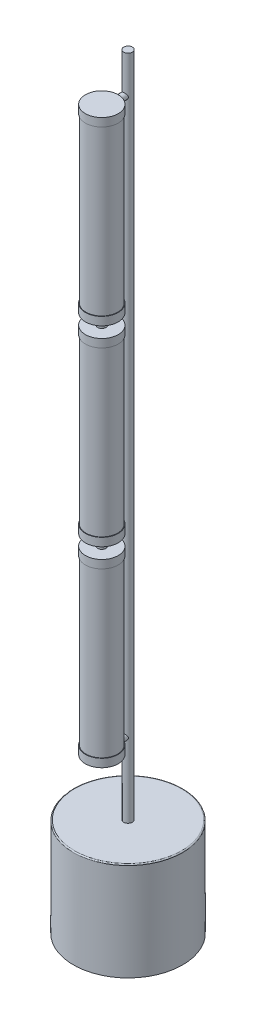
ISO-10303-21;
HEADER;
FILE_DESCRIPTION(('STEP AP214'),'2;1');
FILE_NAME('part.step','',(''),(''),'','','');
FILE_SCHEMA(('AUTOMOTIVE_DESIGN { 1 0 10303 214 1 1 1 1 }'));
ENDSEC;
DATA;
#1=APPLICATION_CONTEXT('core data for automotive mechanical design processes');
#2=APPLICATION_PROTOCOL_DEFINITION('international standard','automotive_design',2000,#1);
#3=PRODUCT_CONTEXT('',#1,'mechanical');
#4=PRODUCT('Part','Part','',(#3));
#5=PRODUCT_RELATED_PRODUCT_CATEGORY('part','',(#4));
#6=PRODUCT_DEFINITION_FORMATION('','',#4);
#7=PRODUCT_DEFINITION_CONTEXT('part definition',#1,'design');
#8=PRODUCT_DEFINITION('design','',#6,#7);
#9=PRODUCT_DEFINITION_SHAPE('','',#8);
#10=(LENGTH_UNIT() NAMED_UNIT(*) SI_UNIT(.MILLI.,.METRE.));
#11=(NAMED_UNIT(*) PLANE_ANGLE_UNIT() SI_UNIT($,.RADIAN.));
#12=(NAMED_UNIT(*) SI_UNIT($,.STERADIAN.) SOLID_ANGLE_UNIT());
#13=UNCERTAINTY_MEASURE_WITH_UNIT(LENGTH_MEASURE(1.E-05),#10,'distance_accuracy_value','');
#14=(GEOMETRIC_REPRESENTATION_CONTEXT(3) GLOBAL_UNCERTAINTY_ASSIGNED_CONTEXT((#13)) GLOBAL_UNIT_ASSIGNED_CONTEXT((#10,
#11,#12)) REPRESENTATION_CONTEXT('',''));
#15=CARTESIAN_POINT('',(0.,0.,0.));
#16=DIRECTION('',(0.,0.,1.));
#17=DIRECTION('',(1.,0.,0.));
#18=AXIS2_PLACEMENT_3D('',#15,#16,#17);
#19=CARTESIAN_POINT('',(-175.068863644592,345.181207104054,1328.));
#20=DIRECTION('',(0.,-1.,0.));
#21=DIRECTION('',(0.187098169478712,0.,-0.982341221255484));
#22=AXIS2_PLACEMENT_3D('',#19,#20,#21);
#23=CYLINDRICAL_SURFACE('',#22,30.);
#24=CARTESIAN_POINT('',(-175.068863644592,345.181207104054,1328.));
#25=DIRECTION('',(0.,1.,0.));
#26=DIRECTION('',(-0.187098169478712,0.,0.982341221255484));
#27=AXIS2_PLACEMENT_3D('',#24,#25,#26);
#28=CIRCLE('',#27,30.);
#29=CARTESIAN_POINT('',(-169.45591856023,345.181207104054,1298.52976336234));
#30=VERTEX_POINT('',#29);
#31=EDGE_CURVE('P0_E10',#30,#30,#28,.T.);
#32=CARTESIAN_POINT('',(-175.068863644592,330.181207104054,1328.));
#33=DIRECTION('',(0.,1.,0.));
#34=DIRECTION('',(-0.187098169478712,0.,0.982341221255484));
#35=AXIS2_PLACEMENT_3D('',#32,#33,#34);
#36=CIRCLE('',#35,30.);
#37=CARTESIAN_POINT('',(-169.455918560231,330.181207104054,1298.52976336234));
#38=VERTEX_POINT('',#37);
#39=EDGE_CURVE('P0_E18',#38,#38,#36,.T.);
#40=CARTESIAN_POINT('',(-169.45591856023,345.181207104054,1298.52976336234));
#41=CARTESIAN_POINT('',(-169.45591856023,345.024957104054,1298.52976336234));
#42=CARTESIAN_POINT('',(-169.45591856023,344.868707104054,1298.52976336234));
#43=CARTESIAN_POINT('',(-169.45591856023,344.556207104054,1298.52976336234));
#44=CARTESIAN_POINT('',(-169.45591856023,344.399957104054,1298.52976336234));
#45=CARTESIAN_POINT('',(-169.45591856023,344.087457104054,1298.52976336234));
#46=CARTESIAN_POINT('',(-169.45591856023,343.931207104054,1298.52976336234));
#47=CARTESIAN_POINT('',(-169.45591856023,343.618707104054,1298.52976336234));
#48=CARTESIAN_POINT('',(-169.45591856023,343.462457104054,1298.52976336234));
#49=CARTESIAN_POINT('',(-169.45591856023,343.149957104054,1298.52976336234));
#50=CARTESIAN_POINT('',(-169.45591856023,342.993707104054,1298.52976336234));
#51=CARTESIAN_POINT('',(-169.45591856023,342.681207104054,1298.52976336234));
#52=CARTESIAN_POINT('',(-169.45591856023,342.524957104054,1298.52976336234));
#53=CARTESIAN_POINT('',(-169.45591856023,342.212457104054,1298.52976336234));
#54=CARTESIAN_POINT('',(-169.45591856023,342.056207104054,1298.52976336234));
#55=CARTESIAN_POINT('',(-169.45591856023,341.743707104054,1298.52976336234));
#56=CARTESIAN_POINT('',(-169.45591856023,341.587457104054,1298.52976336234));
#57=CARTESIAN_POINT('',(-169.45591856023,341.274957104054,1298.52976336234));
#58=CARTESIAN_POINT('',(-169.45591856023,341.118707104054,1298.52976336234));
#59=CARTESIAN_POINT('',(-169.45591856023,340.806207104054,1298.52976336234));
#60=CARTESIAN_POINT('',(-169.45591856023,340.649957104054,1298.52976336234));
#61=CARTESIAN_POINT('',(-169.45591856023,340.337457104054,1298.52976336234));
#62=CARTESIAN_POINT('',(-169.45591856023,340.181207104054,1298.52976336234));
#63=CARTESIAN_POINT('',(-169.45591856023,339.868707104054,1298.52976336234));
#64=CARTESIAN_POINT('',(-169.45591856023,339.712457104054,1298.52976336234));
#65=CARTESIAN_POINT('',(-169.45591856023,339.399957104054,1298.52976336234));
#66=CARTESIAN_POINT('',(-169.45591856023,339.243707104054,1298.52976336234));
#67=CARTESIAN_POINT('',(-169.45591856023,338.931207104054,1298.52976336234));
#68=CARTESIAN_POINT('',(-169.45591856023,338.774957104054,1298.52976336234));
#69=CARTESIAN_POINT('',(-169.45591856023,338.462457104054,1298.52976336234));
#70=CARTESIAN_POINT('',(-169.45591856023,338.306207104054,1298.52976336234));
#71=CARTESIAN_POINT('',(-169.45591856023,337.993707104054,1298.52976336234));
#72=CARTESIAN_POINT('',(-169.45591856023,337.837457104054,1298.52976336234));
#73=CARTESIAN_POINT('',(-169.45591856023,337.524957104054,1298.52976336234));
#74=CARTESIAN_POINT('',(-169.45591856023,337.368707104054,1298.52976336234));
#75=CARTESIAN_POINT('',(-169.45591856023,337.056207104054,1298.52976336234));
#76=CARTESIAN_POINT('',(-169.455918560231,336.899957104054,1298.52976336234));
#77=CARTESIAN_POINT('',(-169.455918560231,336.587457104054,1298.52976336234));
#78=CARTESIAN_POINT('',(-169.455918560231,336.431207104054,1298.52976336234));
#79=CARTESIAN_POINT('',(-169.455918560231,336.118707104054,1298.52976336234));
#80=CARTESIAN_POINT('',(-169.455918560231,335.962457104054,1298.52976336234));
#81=CARTESIAN_POINT('',(-169.455918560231,335.649957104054,1298.52976336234));
#82=CARTESIAN_POINT('',(-169.455918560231,335.493707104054,1298.52976336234));
#83=CARTESIAN_POINT('',(-169.455918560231,335.181207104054,1298.52976336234));
#84=CARTESIAN_POINT('',(-169.455918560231,335.024957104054,1298.52976336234));
#85=CARTESIAN_POINT('',(-169.455918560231,334.712457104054,1298.52976336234));
#86=CARTESIAN_POINT('',(-169.455918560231,334.556207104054,1298.52976336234));
#87=CARTESIAN_POINT('',(-169.455918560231,334.243707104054,1298.52976336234));
#88=CARTESIAN_POINT('',(-169.455918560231,334.087457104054,1298.52976336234));
#89=CARTESIAN_POINT('',(-169.455918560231,333.774957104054,1298.52976336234));
#90=CARTESIAN_POINT('',(-169.455918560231,333.618707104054,1298.52976336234));
#91=CARTESIAN_POINT('',(-169.455918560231,333.306207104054,1298.52976336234));
#92=CARTESIAN_POINT('',(-169.455918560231,333.149957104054,1298.52976336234));
#93=CARTESIAN_POINT('',(-169.455918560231,332.837457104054,1298.52976336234));
#94=CARTESIAN_POINT('',(-169.455918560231,332.681207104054,1298.52976336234));
#95=CARTESIAN_POINT('',(-169.455918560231,332.368707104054,1298.52976336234));
#96=CARTESIAN_POINT('',(-169.455918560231,332.212457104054,1298.52976336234));
#97=CARTESIAN_POINT('',(-169.455918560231,331.899957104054,1298.52976336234));
#98=CARTESIAN_POINT('',(-169.455918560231,331.743707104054,1298.52976336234));
#99=CARTESIAN_POINT('',(-169.455918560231,331.431207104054,1298.52976336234));
#100=CARTESIAN_POINT('',(-169.455918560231,331.274957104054,1298.52976336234));
#101=CARTESIAN_POINT('',(-169.455918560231,330.962457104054,1298.52976336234));
#102=CARTESIAN_POINT('',(-169.455918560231,330.806207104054,1298.52976336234));
#103=CARTESIAN_POINT('',(-169.455918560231,330.493707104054,1298.52976336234));
#104=CARTESIAN_POINT('',(-169.455918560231,330.337457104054,1298.52976336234));
#105=CARTESIAN_POINT('',(-169.455918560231,330.181207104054,1298.52976336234));
#106=B_SPLINE_CURVE_WITH_KNOTS('',3,(#40,#41,#42,#43,#44,#45,#46,#47,#48,#49,#50,#51,#52,#53,
#54,#55,#56,#57,#58,#59,#60,#61,#62,#63,#64,#65,#66,#67,#68,#69,#70,#71,#72,#73,#74,#75,#76,#77,
#78,#79,#80,#81,#82,#83,#84,#85,#86,#87,#88,#89,#90,#91,#92,#93,#94,#95,#96,#97,#98,#99,#100,
#101,#102,#103,#104,#105),.UNSPECIFIED.,.F.,.F.,(4,2,2,2,2,2,2,2,2,2,2,2,2,2,2,2,2,2,2,2,2,2,2,
2,2,2,2,2,2,2,2,2,4),(0.,0.468750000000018,0.937500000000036,1.40625000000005,1.87500000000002,
2.34375000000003,2.81250000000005,3.28125000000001,3.75000000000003,4.21875000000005,
4.68750000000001,5.15625000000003,5.62500000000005,6.09375000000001,6.56250000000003,
7.03125000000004,7.50000000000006,7.96875000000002,8.43750000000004,8.90625000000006,
9.37500000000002,9.84375000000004,10.3125000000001,10.78125,11.25,11.7187500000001,12.1875,
12.65625,13.1250000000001,13.59375,14.0625,14.5312500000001,15.0000000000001),.UNSPECIFIED.);
#107=EDGE_CURVE('P0_BSEAM15',#30,#38,#106,.T.);
#108=ORIENTED_EDGE('',*,*,#31,.F.);
#109=ORIENTED_EDGE('',*,*,#39,.T.);
#110=ORIENTED_EDGE('',*,*,#107,.T.);
#111=ORIENTED_EDGE('',*,*,#107,.F.);
#112=EDGE_LOOP('',(#108,#110,#109,#111));
#113=FACE_BOUND('',#112,.T.);
#114=ADVANCED_FACE('P0_F15',(#113),#23,.T.);
#115=CARTESIAN_POINT('',(-175.068863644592,345.181207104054,1328.));
#116=DIRECTION('',(0.,1.,0.));
#117=DIRECTION('',(-0.187098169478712,0.,0.982341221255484));
#118=AXIS2_PLACEMENT_3D('',#115,#116,#117);
#119=PLANE('',#118);
#120=ORIENTED_EDGE('',*,*,#31,.T.);
#121=EDGE_LOOP('',(#120));
#122=FACE_BOUND('',#121,.T.);
#123=ADVANCED_FACE('P0_F30',(#122),#119,.T.);
#124=CARTESIAN_POINT('',(-175.068863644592,330.181207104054,1328.));
#125=DIRECTION('',(0.,1.,0.));
#126=DIRECTION('',(-0.187098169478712,0.,0.982341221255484));
#127=AXIS2_PLACEMENT_3D('',#124,#125,#126);
#128=PLANE('',#127);
#129=ORIENTED_EDGE('',*,*,#39,.F.);
#130=EDGE_LOOP('',(#129));
#131=FACE_BOUND('',#130,.T.);
#132=ADVANCED_FACE('P0_F28',(#131),#128,.F.);
#133=CLOSED_SHELL('',(#114,#123,#132));
#134=MANIFOLD_SOLID_BREP('P0_B1',#133);
#135=CARTESIAN_POINT('',(-175.068863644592,330.181207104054,1328.));
#136=DIRECTION('',(0.,-1.,0.));
#137=DIRECTION('',(0.187098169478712,0.,-0.982341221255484));
#138=AXIS2_PLACEMENT_3D('',#135,#136,#137);
#139=CYLINDRICAL_SURFACE('',#138,29.);
#140=CARTESIAN_POINT('',(-175.068863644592,330.181207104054,1328.));
#141=DIRECTION('',(0.,1.,0.));
#142=DIRECTION('',(-0.187098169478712,0.,0.982341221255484));
#143=AXIS2_PLACEMENT_3D('',#140,#141,#142);
#144=CIRCLE('',#143,29.);
#145=CARTESIAN_POINT('',(-169.643016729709,330.181207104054,1299.51210458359));
#146=VERTEX_POINT('',#145);
#147=EDGE_CURVE('P1_E10',#146,#146,#144,.T.);
#148=CARTESIAN_POINT('',(-175.068863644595,30.1812071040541,1328.));
#149=DIRECTION('',(0.,1.,0.));
#150=DIRECTION('',(-0.187098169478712,0.,0.982341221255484));
#151=AXIS2_PLACEMENT_3D('',#148,#149,#150);
#152=CIRCLE('',#151,29.);
#153=CARTESIAN_POINT('',(-169.643016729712,30.181207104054,1299.51210458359));
#154=VERTEX_POINT('',#153);
#155=EDGE_CURVE('P1_E18',#154,#154,#152,.T.);
#156=CARTESIAN_POINT('',(-169.643016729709,330.181207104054,1299.51210458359));
#157=CARTESIAN_POINT('',(-169.643016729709,327.056207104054,1299.51210458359));
#158=CARTESIAN_POINT('',(-169.643016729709,323.931207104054,1299.51210458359));
#159=CARTESIAN_POINT('',(-169.643016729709,317.681207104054,1299.51210458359));
#160=CARTESIAN_POINT('',(-169.643016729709,314.556207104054,1299.51210458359));
#161=CARTESIAN_POINT('',(-169.643016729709,308.306207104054,1299.51210458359));
#162=CARTESIAN_POINT('',(-169.64301672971,305.181207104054,1299.51210458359));
#163=CARTESIAN_POINT('',(-169.64301672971,298.931207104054,1299.51210458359));
#164=CARTESIAN_POINT('',(-169.64301672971,295.806207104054,1299.51210458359));
#165=CARTESIAN_POINT('',(-169.64301672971,289.556207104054,1299.51210458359));
#166=CARTESIAN_POINT('',(-169.64301672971,286.431207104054,1299.51210458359));
#167=CARTESIAN_POINT('',(-169.64301672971,280.181207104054,1299.51210458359));
#168=CARTESIAN_POINT('',(-169.64301672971,277.056207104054,1299.51210458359));
#169=CARTESIAN_POINT('',(-169.64301672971,270.806207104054,1299.51210458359));
#170=CARTESIAN_POINT('',(-169.64301672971,267.681207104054,1299.51210458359));
#171=CARTESIAN_POINT('',(-169.64301672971,261.431207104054,1299.51210458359));
#172=CARTESIAN_POINT('',(-169.64301672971,258.306207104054,1299.51210458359));
#173=CARTESIAN_POINT('',(-169.64301672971,252.056207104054,1299.51210458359));
#174=CARTESIAN_POINT('',(-169.64301672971,248.931207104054,1299.51210458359));
#175=CARTESIAN_POINT('',(-169.64301672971,242.681207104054,1299.51210458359));
#176=CARTESIAN_POINT('',(-169.64301672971,239.556207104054,1299.51210458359));
#177=CARTESIAN_POINT('',(-169.64301672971,233.306207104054,1299.51210458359));
#178=CARTESIAN_POINT('',(-169.64301672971,230.181207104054,1299.51210458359));
#179=CARTESIAN_POINT('',(-169.64301672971,223.931207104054,1299.51210458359));
#180=CARTESIAN_POINT('',(-169.64301672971,220.806207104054,1299.51210458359));
#181=CARTESIAN_POINT('',(-169.64301672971,214.556207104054,1299.51210458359));
#182=CARTESIAN_POINT('',(-169.64301672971,211.431207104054,1299.51210458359));
#183=CARTESIAN_POINT('',(-169.64301672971,205.181207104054,1299.51210458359));
#184=CARTESIAN_POINT('',(-169.64301672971,202.056207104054,1299.51210458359));
#185=CARTESIAN_POINT('',(-169.64301672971,195.806207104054,1299.51210458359));
#186=CARTESIAN_POINT('',(-169.64301672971,192.681207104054,1299.51210458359));
#187=CARTESIAN_POINT('',(-169.643016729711,186.431207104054,1299.51210458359));
#188=CARTESIAN_POINT('',(-169.643016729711,183.306207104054,1299.51210458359));
#189=CARTESIAN_POINT('',(-169.643016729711,177.056207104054,1299.51210458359));
#190=CARTESIAN_POINT('',(-169.643016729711,173.931207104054,1299.51210458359));
#191=CARTESIAN_POINT('',(-169.643016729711,167.681207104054,1299.51210458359));
#192=CARTESIAN_POINT('',(-169.643016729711,164.556207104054,1299.51210458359));
#193=CARTESIAN_POINT('',(-169.643016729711,158.306207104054,1299.51210458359));
#194=CARTESIAN_POINT('',(-169.643016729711,155.181207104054,1299.51210458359));
#195=CARTESIAN_POINT('',(-169.643016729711,148.931207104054,1299.51210458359));
#196=CARTESIAN_POINT('',(-169.643016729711,145.806207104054,1299.51210458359));
#197=CARTESIAN_POINT('',(-169.643016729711,139.556207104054,1299.51210458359));
#198=CARTESIAN_POINT('',(-169.643016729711,136.431207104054,1299.51210458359));
#199=CARTESIAN_POINT('',(-169.643016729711,130.181207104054,1299.51210458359));
#200=CARTESIAN_POINT('',(-169.643016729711,127.056207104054,1299.51210458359));
#201=CARTESIAN_POINT('',(-169.643016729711,120.806207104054,1299.51210458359));
#202=CARTESIAN_POINT('',(-169.643016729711,117.681207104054,1299.51210458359));
#203=CARTESIAN_POINT('',(-169.643016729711,111.431207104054,1299.51210458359));
#204=CARTESIAN_POINT('',(-169.643016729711,108.306207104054,1299.51210458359));
#205=CARTESIAN_POINT('',(-169.643016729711,102.056207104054,1299.51210458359));
#206=CARTESIAN_POINT('',(-169.643016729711,98.931207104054,1299.51210458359));
#207=CARTESIAN_POINT('',(-169.643016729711,92.681207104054,1299.51210458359));
#208=CARTESIAN_POINT('',(-169.643016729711,89.556207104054,1299.51210458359));
#209=CARTESIAN_POINT('',(-169.643016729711,83.306207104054,1299.51210458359));
#210=CARTESIAN_POINT('',(-169.643016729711,80.181207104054,1299.51210458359));
#211=CARTESIAN_POINT('',(-169.643016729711,73.931207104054,1299.51210458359));
#212=CARTESIAN_POINT('',(-169.643016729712,70.8062071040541,1299.51210458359));
#213=CARTESIAN_POINT('',(-169.643016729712,64.5562071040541,1299.51210458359));
#214=CARTESIAN_POINT('',(-169.643016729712,61.4312071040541,1299.51210458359));
#215=CARTESIAN_POINT('',(-169.643016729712,55.181207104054,1299.51210458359));
#216=CARTESIAN_POINT('',(-169.643016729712,52.056207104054,1299.51210458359));
#217=CARTESIAN_POINT('',(-169.643016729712,45.806207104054,1299.51210458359));
#218=CARTESIAN_POINT('',(-169.643016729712,42.681207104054,1299.51210458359));
#219=CARTESIAN_POINT('',(-169.643016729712,36.431207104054,1299.51210458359));
#220=CARTESIAN_POINT('',(-169.643016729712,33.306207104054,1299.51210458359));
#221=CARTESIAN_POINT('',(-169.643016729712,30.181207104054,1299.51210458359));
#222=B_SPLINE_CURVE_WITH_KNOTS('',3,(#156,#157,#158,#159,#160,#161,#162,#163,#164,#165,#166,
#167,#168,#169,#170,#171,#172,#173,#174,#175,#176,#177,#178,#179,#180,#181,#182,#183,#184,#185,
#186,#187,#188,#189,#190,#191,#192,#193,#194,#195,#196,#197,#198,#199,#200,#201,#202,#203,#204,
#205,#206,#207,#208,#209,#210,#211,#212,#213,#214,#215,#216,#217,#218,#219,#220,#221),
.UNSPECIFIED.,.F.,.F.,(4,2,2,2,2,2,2,2,2,2,2,2,2,2,2,2,2,2,2,2,2,2,2,2,2,2,2,2,2,2,2,2,4),(0.,
9.37500000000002,18.75,28.125,37.5,46.8750000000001,56.25,65.625,75.0000000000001,84.375,
93.7500000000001,103.125,112.5,121.875,131.25,140.625,150.,159.375,168.75,178.125,187.5,196.875,
206.25,215.625,225.,234.375,243.75,253.125,262.5,271.875,281.25,290.625,300.),.UNSPECIFIED.);
#223=EDGE_CURVE('P1_BSEAM15',#146,#154,#222,.T.);
#224=ORIENTED_EDGE('',*,*,#147,.F.);
#225=ORIENTED_EDGE('',*,*,#155,.T.);
#226=ORIENTED_EDGE('',*,*,#223,.T.);
#227=ORIENTED_EDGE('',*,*,#223,.F.);
#228=EDGE_LOOP('',(#224,#226,#225,#227));
#229=FACE_BOUND('',#228,.T.);
#230=ADVANCED_FACE('P1_F15',(#229),#139,.T.);
#231=CARTESIAN_POINT('',(-175.068863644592,330.181207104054,1328.));
#232=DIRECTION('',(0.,1.,0.));
#233=DIRECTION('',(-0.187098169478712,0.,0.982341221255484));
#234=AXIS2_PLACEMENT_3D('',#231,#232,#233);
#235=PLANE('',#234);
#236=ORIENTED_EDGE('',*,*,#147,.T.);
#237=EDGE_LOOP('',(#236));
#238=FACE_BOUND('',#237,.T.);
#239=ADVANCED_FACE('P1_F30',(#238),#235,.T.);
#240=CARTESIAN_POINT('',(-175.068863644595,30.1812071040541,1328.));
#241=DIRECTION('',(0.,1.,0.));
#242=DIRECTION('',(-0.187098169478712,0.,0.982341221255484));
#243=AXIS2_PLACEMENT_3D('',#240,#241,#242);
#244=PLANE('',#243);
#245=ORIENTED_EDGE('',*,*,#155,.F.);
#246=EDGE_LOOP('',(#245));
#247=FACE_BOUND('',#246,.T.);
#248=ADVANCED_FACE('P1_F28',(#247),#244,.F.);
#249=CLOSED_SHELL('',(#230,#239,#248));
#250=MANIFOLD_SOLID_BREP('P1_B1',#249);
#251=CARTESIAN_POINT('',(-175.068863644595,30.1812071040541,1328.));
#252=DIRECTION('',(0.,-1.,0.));
#253=DIRECTION('',(0.187098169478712,0.,-0.982341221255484));
#254=AXIS2_PLACEMENT_3D('',#251,#252,#253);
#255=CYLINDRICAL_SURFACE('',#254,30.);
#256=CARTESIAN_POINT('',(-175.068863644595,30.1812071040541,1328.));
#257=DIRECTION('',(0.,1.,0.));
#258=DIRECTION('',(-0.187098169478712,0.,0.982341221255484));
#259=AXIS2_PLACEMENT_3D('',#256,#257,#258);
#260=CIRCLE('',#259,30.);
#261=CARTESIAN_POINT('',(-169.455918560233,30.1812071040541,1298.52976336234));
#262=VERTEX_POINT('',#261);
#263=EDGE_CURVE('P2_E10',#262,#262,#260,.T.);
#264=CARTESIAN_POINT('',(-175.068863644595,15.1812071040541,1328.));
#265=DIRECTION('',(0.,1.,0.));
#266=DIRECTION('',(-0.187098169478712,0.,0.982341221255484));
#267=AXIS2_PLACEMENT_3D('',#264,#265,#266);
#268=CIRCLE('',#267,30.);
#269=CARTESIAN_POINT('',(-169.455918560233,15.1812071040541,1298.52976336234));
#270=VERTEX_POINT('',#269);
#271=EDGE_CURVE('P2_E18',#270,#270,#268,.T.);
#272=CARTESIAN_POINT('',(-169.455918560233,30.1812071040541,1298.52976336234));
#273=CARTESIAN_POINT('',(-169.455918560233,30.0249571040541,1298.52976336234));
#274=CARTESIAN_POINT('',(-169.455918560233,29.8687071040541,1298.52976336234));
#275=CARTESIAN_POINT('',(-169.455918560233,29.5562071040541,1298.52976336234));
#276=CARTESIAN_POINT('',(-169.455918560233,29.3999571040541,1298.52976336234));
#277=CARTESIAN_POINT('',(-169.455918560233,29.0874571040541,1298.52976336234));
#278=CARTESIAN_POINT('',(-169.455918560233,28.9312071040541,1298.52976336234));
#279=CARTESIAN_POINT('',(-169.455918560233,28.6187071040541,1298.52976336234));
#280=CARTESIAN_POINT('',(-169.455918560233,28.4624571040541,1298.52976336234));
#281=CARTESIAN_POINT('',(-169.455918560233,28.1499571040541,1298.52976336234));
#282=CARTESIAN_POINT('',(-169.455918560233,27.9937071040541,1298.52976336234));
#283=CARTESIAN_POINT('',(-169.455918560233,27.6812071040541,1298.52976336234));
#284=CARTESIAN_POINT('',(-169.455918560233,27.5249571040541,1298.52976336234));
#285=CARTESIAN_POINT('',(-169.455918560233,27.2124571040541,1298.52976336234));
#286=CARTESIAN_POINT('',(-169.455918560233,27.0562071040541,1298.52976336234));
#287=CARTESIAN_POINT('',(-169.455918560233,26.7437071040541,1298.52976336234));
#288=CARTESIAN_POINT('',(-169.455918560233,26.5874571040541,1298.52976336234));
#289=CARTESIAN_POINT('',(-169.455918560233,26.2749571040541,1298.52976336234));
#290=CARTESIAN_POINT('',(-169.455918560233,26.1187071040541,1298.52976336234));
#291=CARTESIAN_POINT('',(-169.455918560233,25.8062071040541,1298.52976336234));
#292=CARTESIAN_POINT('',(-169.455918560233,25.6499571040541,1298.52976336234));
#293=CARTESIAN_POINT('',(-169.455918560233,25.3374571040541,1298.52976336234));
#294=CARTESIAN_POINT('',(-169.455918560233,25.1812071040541,1298.52976336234));
#295=CARTESIAN_POINT('',(-169.455918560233,24.8687071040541,1298.52976336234));
#296=CARTESIAN_POINT('',(-169.455918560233,24.7124571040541,1298.52976336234));
#297=CARTESIAN_POINT('',(-169.455918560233,24.3999571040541,1298.52976336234));
#298=CARTESIAN_POINT('',(-169.455918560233,24.2437071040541,1298.52976336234));
#299=CARTESIAN_POINT('',(-169.455918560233,23.9312071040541,1298.52976336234));
#300=CARTESIAN_POINT('',(-169.455918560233,23.7749571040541,1298.52976336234));
#301=CARTESIAN_POINT('',(-169.455918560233,23.4624571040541,1298.52976336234));
#302=CARTESIAN_POINT('',(-169.455918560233,23.3062071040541,1298.52976336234));
#303=CARTESIAN_POINT('',(-169.455918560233,22.9937071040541,1298.52976336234));
#304=CARTESIAN_POINT('',(-169.455918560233,22.8374571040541,1298.52976336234));
#305=CARTESIAN_POINT('',(-169.455918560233,22.5249571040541,1298.52976336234));
#306=CARTESIAN_POINT('',(-169.455918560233,22.3687071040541,1298.52976336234));
#307=CARTESIAN_POINT('',(-169.455918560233,22.0562071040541,1298.52976336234));
#308=CARTESIAN_POINT('',(-169.455918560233,21.8999571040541,1298.52976336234));
#309=CARTESIAN_POINT('',(-169.455918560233,21.5874571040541,1298.52976336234));
#310=CARTESIAN_POINT('',(-169.455918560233,21.4312071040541,1298.52976336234));
#311=CARTESIAN_POINT('',(-169.455918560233,21.1187071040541,1298.52976336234));
#312=CARTESIAN_POINT('',(-169.455918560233,20.9624571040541,1298.52976336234));
#313=CARTESIAN_POINT('',(-169.455918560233,20.6499571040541,1298.52976336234));
#314=CARTESIAN_POINT('',(-169.455918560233,20.4937071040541,1298.52976336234));
#315=CARTESIAN_POINT('',(-169.455918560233,20.1812071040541,1298.52976336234));
#316=CARTESIAN_POINT('',(-169.455918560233,20.0249571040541,1298.52976336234));
#317=CARTESIAN_POINT('',(-169.455918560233,19.7124571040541,1298.52976336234));
#318=CARTESIAN_POINT('',(-169.455918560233,19.5562071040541,1298.52976336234));
#319=CARTESIAN_POINT('',(-169.455918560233,19.2437071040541,1298.52976336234));
#320=CARTESIAN_POINT('',(-169.455918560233,19.0874571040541,1298.52976336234));
#321=CARTESIAN_POINT('',(-169.455918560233,18.7749571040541,1298.52976336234));
#322=CARTESIAN_POINT('',(-169.455918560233,18.6187071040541,1298.52976336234));
#323=CARTESIAN_POINT('',(-169.455918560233,18.3062071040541,1298.52976336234));
#324=CARTESIAN_POINT('',(-169.455918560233,18.1499571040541,1298.52976336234));
#325=CARTESIAN_POINT('',(-169.455918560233,17.8374571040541,1298.52976336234));
#326=CARTESIAN_POINT('',(-169.455918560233,17.6812071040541,1298.52976336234));
#327=CARTESIAN_POINT('',(-169.455918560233,17.3687071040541,1298.52976336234));
#328=CARTESIAN_POINT('',(-169.455918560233,17.2124571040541,1298.52976336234));
#329=CARTESIAN_POINT('',(-169.455918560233,16.8999571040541,1298.52976336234));
#330=CARTESIAN_POINT('',(-169.455918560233,16.7437071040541,1298.52976336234));
#331=CARTESIAN_POINT('',(-169.455918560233,16.4312071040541,1298.52976336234));
#332=CARTESIAN_POINT('',(-169.455918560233,16.2749571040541,1298.52976336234));
#333=CARTESIAN_POINT('',(-169.455918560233,15.9624571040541,1298.52976336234));
#334=CARTESIAN_POINT('',(-169.455918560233,15.8062071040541,1298.52976336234));
#335=CARTESIAN_POINT('',(-169.455918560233,15.4937071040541,1298.52976336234));
#336=CARTESIAN_POINT('',(-169.455918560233,15.3374571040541,1298.52976336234));
#337=CARTESIAN_POINT('',(-169.455918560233,15.1812071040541,1298.52976336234));
#338=B_SPLINE_CURVE_WITH_KNOTS('',3,(#272,#273,#274,#275,#276,#277,#278,#279,#280,#281,#282,
#283,#284,#285,#286,#287,#288,#289,#290,#291,#292,#293,#294,#295,#296,#297,#298,#299,#300,#301,
#302,#303,#304,#305,#306,#307,#308,#309,#310,#311,#312,#313,#314,#315,#316,#317,#318,#319,#320,
#321,#322,#323,#324,#325,#326,#327,#328,#329,#330,#331,#332,#333,#334,#335,#336,#337),
.UNSPECIFIED.,.F.,.F.,(4,2,2,2,2,2,2,2,2,2,2,2,2,2,2,2,2,2,2,2,2,2,2,2,2,2,2,2,2,2,2,2,4),(0.,
0.46875,0.937500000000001,1.40625,1.875,2.34375,2.8125,3.28125,3.75,4.21875,4.6875,5.15625,
5.625,6.09375,6.5625,7.03125,7.5,7.96875,8.4375,8.90625,9.375,9.84375,10.3125,10.78125,11.25,
11.71875,12.1875,12.65625,13.125,13.59375,14.0625,14.53125,15.),.UNSPECIFIED.);
#339=EDGE_CURVE('P2_BSEAM15',#262,#270,#338,.T.);
#340=ORIENTED_EDGE('',*,*,#263,.F.);
#341=ORIENTED_EDGE('',*,*,#271,.T.);
#342=ORIENTED_EDGE('',*,*,#339,.T.);
#343=ORIENTED_EDGE('',*,*,#339,.F.);
#344=EDGE_LOOP('',(#340,#342,#341,#343));
#345=FACE_BOUND('',#344,.T.);
#346=ADVANCED_FACE('P2_F15',(#345),#255,.T.);
#347=CARTESIAN_POINT('',(-175.068863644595,30.1812071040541,1328.));
#348=DIRECTION('',(0.,1.,0.));
#349=DIRECTION('',(-0.187098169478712,0.,0.982341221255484));
#350=AXIS2_PLACEMENT_3D('',#347,#348,#349);
#351=PLANE('',#350);
#352=ORIENTED_EDGE('',*,*,#263,.T.);
#353=EDGE_LOOP('',(#352));
#354=FACE_BOUND('',#353,.T.);
#355=ADVANCED_FACE('P2_F30',(#354),#351,.T.);
#356=CARTESIAN_POINT('',(-175.068863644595,15.1812071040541,1328.));
#357=DIRECTION('',(0.,1.,0.));
#358=DIRECTION('',(-0.187098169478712,0.,0.982341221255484));
#359=AXIS2_PLACEMENT_3D('',#356,#357,#358);
#360=PLANE('',#359);
#361=ORIENTED_EDGE('',*,*,#271,.F.);
#362=EDGE_LOOP('',(#361));
#363=FACE_BOUND('',#362,.T.);
#364=ADVANCED_FACE('P2_F28',(#363),#360,.F.);
#365=CLOSED_SHELL('',(#346,#355,#364));
#366=MANIFOLD_SOLID_BREP('P2_B1',#365);
#367=CARTESIAN_POINT('',(-175.068863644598,-327.318792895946,1300.));
#368=DIRECTION('',(0.,0.,-1.));
#369=DIRECTION('',(-1.,0.,0.));
#370=AXIS2_PLACEMENT_3D('',#367,#368,#369);
#371=CYLINDRICAL_SURFACE('',#370,6.00000000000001);
#372=CARTESIAN_POINT('',(-175.068863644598,-327.318792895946,1300.));
#373=DIRECTION('',(0.,0.,1.));
#374=DIRECTION('',(1.,0.,0.));
#375=AXIS2_PLACEMENT_3D('',#372,#373,#374);
#376=CIRCLE('',#375,6.00000000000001);
#377=CARTESIAN_POINT('',(-169.068863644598,-327.318792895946,1300.));
#378=VERTEX_POINT('',#377);
#379=EDGE_CURVE('P3_E10',#378,#378,#376,.T.);
#380=ORIENTED_EDGE('',*,*,#379,.F.);
#381=EDGE_LOOP('',(#380));
#382=FACE_BOUND('',#381,.T.);
#383=CARTESIAN_POINT('',(-175.068863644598,-327.318792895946,1280.));
#384=DIRECTION('',(0.,0.,1.));
#385=DIRECTION('',(1.,0.,0.));
#386=AXIS2_PLACEMENT_3D('',#383,#384,#385);
#387=CIRCLE('',#386,6.00000000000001);
#388=CARTESIAN_POINT('',(-169.068863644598,-327.318792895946,1280.));
#389=VERTEX_POINT('',#388);
#390=EDGE_CURVE('P3_E18',#389,#389,#387,.T.);
#391=ORIENTED_EDGE('',*,*,#390,.T.);
#392=EDGE_LOOP('',(#391));
#393=FACE_BOUND('',#392,.T.);
#394=ADVANCED_FACE('P3_F15',(#382,#393),#371,.T.);
#395=CARTESIAN_POINT('',(-175.068863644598,-327.318792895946,1300.));
#396=DIRECTION('',(0.,0.,1.));
#397=DIRECTION('',(1.,0.,0.));
#398=AXIS2_PLACEMENT_3D('',#395,#396,#397);
#399=PLANE('',#398);
#400=ORIENTED_EDGE('',*,*,#379,.T.);
#401=EDGE_LOOP('',(#400));
#402=FACE_BOUND('',#401,.T.);
#403=ADVANCED_FACE('P3_F30',(#402),#399,.T.);
#404=CARTESIAN_POINT('',(-175.068863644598,-327.318792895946,1280.));
#405=DIRECTION('',(0.,0.,1.));
#406=DIRECTION('',(1.,0.,0.));
#407=AXIS2_PLACEMENT_3D('',#404,#405,#406);
#408=PLANE('',#407);
#409=ORIENTED_EDGE('',*,*,#390,.F.);
#410=EDGE_LOOP('',(#409));
#411=FACE_BOUND('',#410,.T.);
#412=ADVANCED_FACE('P3_F28',(#411),#408,.F.);
#413=CLOSED_SHELL('',(#394,#403,#412));
#414=MANIFOLD_SOLID_BREP('P3_B1',#413);
#415=CARTESIAN_POINT('',(-175.068863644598,687.681207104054,1300.));
#416=DIRECTION('',(0.,0.,-1.));
#417=DIRECTION('',(-1.,0.,0.));
#418=AXIS2_PLACEMENT_3D('',#415,#416,#417);
#419=CYLINDRICAL_SURFACE('',#418,6.00000000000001);
#420=CARTESIAN_POINT('',(-175.068863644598,687.681207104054,1300.));
#421=DIRECTION('',(0.,0.,1.));
#422=DIRECTION('',(1.,0.,0.));
#423=AXIS2_PLACEMENT_3D('',#420,#421,#422);
#424=CIRCLE('',#423,6.00000000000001);
#425=CARTESIAN_POINT('',(-169.068863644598,687.681207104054,1300.));
#426=VERTEX_POINT('',#425);
#427=EDGE_CURVE('P4_E10',#426,#426,#424,.T.);
#428=ORIENTED_EDGE('',*,*,#427,.F.);
#429=EDGE_LOOP('',(#428));
#430=FACE_BOUND('',#429,.T.);
#431=CARTESIAN_POINT('',(-175.068863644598,687.681207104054,1280.));
#432=DIRECTION('',(0.,0.,1.));
#433=DIRECTION('',(1.,0.,0.));
#434=AXIS2_PLACEMENT_3D('',#431,#432,#433);
#435=CIRCLE('',#434,6.00000000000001);
#436=CARTESIAN_POINT('',(-169.068863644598,687.681207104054,1280.));
#437=VERTEX_POINT('',#436);
#438=EDGE_CURVE('P4_E18',#437,#437,#435,.T.);
#439=ORIENTED_EDGE('',*,*,#438,.T.);
#440=EDGE_LOOP('',(#439));
#441=FACE_BOUND('',#440,.T.);
#442=ADVANCED_FACE('P4_F15',(#430,#441),#419,.T.);
#443=CARTESIAN_POINT('',(-175.068863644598,687.681207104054,1300.));
#444=DIRECTION('',(0.,0.,1.));
#445=DIRECTION('',(1.,0.,0.));
#446=AXIS2_PLACEMENT_3D('',#443,#444,#445);
#447=PLANE('',#446);
#448=ORIENTED_EDGE('',*,*,#427,.T.);
#449=EDGE_LOOP('',(#448));
#450=FACE_BOUND('',#449,.T.);
#451=ADVANCED_FACE('P4_F30',(#450),#447,.T.);
#452=CARTESIAN_POINT('',(-175.068863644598,687.681207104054,1280.));
#453=DIRECTION('',(0.,0.,1.));
#454=DIRECTION('',(1.,0.,0.));
#455=AXIS2_PLACEMENT_3D('',#452,#453,#454);
#456=PLANE('',#455);
#457=ORIENTED_EDGE('',*,*,#438,.F.);
#458=EDGE_LOOP('',(#457));
#459=FACE_BOUND('',#458,.T.);
#460=ADVANCED_FACE('P4_F28',(#459),#456,.F.);
#461=CLOSED_SHELL('',(#442,#451,#460));
#462=MANIFOLD_SOLID_BREP('P4_B1',#461);
#463=CARTESIAN_POINT('',(-175.068863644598,757.681207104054,1280.));
#464=DIRECTION('',(0.,-1.,0.));
#465=DIRECTION('',(0.,0.,-1.));
#466=AXIS2_PLACEMENT_3D('',#463,#464,#465);
#467=CYLINDRICAL_SURFACE('',#466,8.);
#468=CARTESIAN_POINT('',(-175.068863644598,757.681207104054,1280.));
#469=DIRECTION('',(0.,1.,0.));
#470=DIRECTION('',(0.,0.,1.));
#471=AXIS2_PLACEMENT_3D('',#468,#469,#470);
#472=CIRCLE('',#471,8.);
#473=CARTESIAN_POINT('',(-175.068863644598,757.681207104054,1288.));
#474=VERTEX_POINT('',#473);
#475=EDGE_CURVE('P5_E10',#474,#474,#472,.T.);
#476=ORIENTED_EDGE('',*,*,#475,.F.);
#477=EDGE_LOOP('',(#476));
#478=FACE_BOUND('',#477,.T.);
#479=CARTESIAN_POINT('',(-175.068863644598,-462.318792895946,1280.));
#480=DIRECTION('',(0.,1.,0.));
#481=DIRECTION('',(0.,0.,1.));
#482=AXIS2_PLACEMENT_3D('',#479,#480,#481);
#483=CIRCLE('',#482,8.);
#484=CARTESIAN_POINT('',(-175.068863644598,-462.318792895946,1288.));
#485=VERTEX_POINT('',#484);
#486=EDGE_CURVE('P5_E18',#485,#485,#483,.T.);
#487=ORIENTED_EDGE('',*,*,#486,.T.);
#488=EDGE_LOOP('',(#487));
#489=FACE_BOUND('',#488,.T.);
#490=ADVANCED_FACE('P5_F15',(#478,#489),#467,.T.);
#491=CARTESIAN_POINT('',(-175.068863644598,757.681207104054,1280.));
#492=DIRECTION('',(0.,1.,0.));
#493=DIRECTION('',(0.,0.,1.));
#494=AXIS2_PLACEMENT_3D('',#491,#492,#493);
#495=PLANE('',#494);
#496=ORIENTED_EDGE('',*,*,#475,.T.);
#497=EDGE_LOOP('',(#496));
#498=FACE_BOUND('',#497,.T.);
#499=ADVANCED_FACE('P5_F30',(#498),#495,.T.);
#500=CARTESIAN_POINT('',(-175.068863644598,-462.318792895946,1280.));
#501=DIRECTION('',(0.,1.,0.));
#502=DIRECTION('',(0.,0.,1.));
#503=AXIS2_PLACEMENT_3D('',#500,#501,#502);
#504=PLANE('',#503);
#505=ORIENTED_EDGE('',*,*,#486,.F.);
#506=EDGE_LOOP('',(#505));
#507=FACE_BOUND('',#506,.T.);
#508=ADVANCED_FACE('P5_F28',(#507),#504,.F.);
#509=CLOSED_SHELL('',(#490,#499,#508));
#510=MANIFOLD_SOLID_BREP('P5_B1',#509);
#511=CARTESIAN_POINT('',(-175.068863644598,-462.318792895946,1280.));
#512=DIRECTION('',(0.,-1.,0.));
#513=DIRECTION('',(0.,0.,-1.));
#514=AXIS2_PLACEMENT_3D('',#511,#512,#513);
#515=CYLINDRICAL_SURFACE('',#514,100.);
#516=CARTESIAN_POINT('',(-175.068863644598,-464.318792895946,1280.));
#517=DIRECTION('',(0.,1.,0.));
#518=DIRECTION('',(0.,0.,1.));
#519=AXIS2_PLACEMENT_3D('',#516,#517,#518);
#520=CIRCLE('',#519,100.);
#521=CARTESIAN_POINT('',(-175.068863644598,-464.318792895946,1180.));
#522=VERTEX_POINT('',#521);
#523=EDGE_CURVE('P6_E10',#522,#522,#520,.F.);
#524=CARTESIAN_POINT('',(-175.068863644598,-642.318792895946,1280.));
#525=DIRECTION('',(0.,1.,0.));
#526=DIRECTION('',(0.,0.,1.));
#527=AXIS2_PLACEMENT_3D('',#524,#525,#526);
#528=CIRCLE('',#527,100.);
#529=CARTESIAN_POINT('',(-175.068863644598,-642.318792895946,1180.));
#530=VERTEX_POINT('',#529);
#531=EDGE_CURVE('P6_E26',#530,#530,#528,.T.);
#532=CARTESIAN_POINT('',(-175.068863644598,-464.318792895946,1180.));
#533=CARTESIAN_POINT('',(-175.068863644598,-466.172959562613,1180.));
#534=CARTESIAN_POINT('',(-175.068863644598,-468.027126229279,1180.));
#535=CARTESIAN_POINT('',(-175.068863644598,-471.735459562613,1180.));
#536=CARTESIAN_POINT('',(-175.068863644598,-473.589626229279,1180.));
#537=CARTESIAN_POINT('',(-175.068863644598,-477.297959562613,1180.));
#538=CARTESIAN_POINT('',(-175.068863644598,-479.152126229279,1180.));
#539=CARTESIAN_POINT('',(-175.068863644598,-482.860459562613,1180.));
#540=CARTESIAN_POINT('',(-175.068863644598,-484.714626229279,1180.));
#541=CARTESIAN_POINT('',(-175.068863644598,-488.422959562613,1180.));
#542=CARTESIAN_POINT('',(-175.068863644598,-490.277126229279,1180.));
#543=CARTESIAN_POINT('',(-175.068863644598,-493.985459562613,1180.));
#544=CARTESIAN_POINT('',(-175.068863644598,-495.839626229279,1180.));
#545=CARTESIAN_POINT('',(-175.068863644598,-499.547959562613,1180.));
#546=CARTESIAN_POINT('',(-175.068863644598,-501.402126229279,1180.));
#547=CARTESIAN_POINT('',(-175.068863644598,-505.110459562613,1180.));
#548=CARTESIAN_POINT('',(-175.068863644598,-506.964626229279,1180.));
#549=CARTESIAN_POINT('',(-175.068863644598,-510.672959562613,1180.));
#550=CARTESIAN_POINT('',(-175.068863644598,-512.527126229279,1180.));
#551=CARTESIAN_POINT('',(-175.068863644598,-516.235459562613,1180.));
#552=CARTESIAN_POINT('',(-175.068863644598,-518.089626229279,1180.));
#553=CARTESIAN_POINT('',(-175.068863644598,-521.797959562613,1180.));
#554=CARTESIAN_POINT('',(-175.068863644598,-523.652126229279,1180.));
#555=CARTESIAN_POINT('',(-175.068863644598,-527.360459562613,1180.));
#556=CARTESIAN_POINT('',(-175.068863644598,-529.214626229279,1180.));
#557=CARTESIAN_POINT('',(-175.068863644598,-532.922959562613,1180.));
#558=CARTESIAN_POINT('',(-175.068863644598,-534.777126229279,1180.));
#559=CARTESIAN_POINT('',(-175.068863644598,-538.485459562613,1180.));
#560=CARTESIAN_POINT('',(-175.068863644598,-540.339626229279,1180.));
#561=CARTESIAN_POINT('',(-175.068863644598,-544.047959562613,1180.));
#562=CARTESIAN_POINT('',(-175.068863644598,-545.902126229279,1180.));
#563=CARTESIAN_POINT('',(-175.068863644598,-549.610459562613,1180.));
#564=CARTESIAN_POINT('',(-175.068863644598,-551.464626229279,1180.));
#565=CARTESIAN_POINT('',(-175.068863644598,-555.172959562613,1180.));
#566=CARTESIAN_POINT('',(-175.068863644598,-557.027126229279,1180.));
#567=CARTESIAN_POINT('',(-175.068863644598,-560.735459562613,1180.));
#568=CARTESIAN_POINT('',(-175.068863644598,-562.589626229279,1180.));
#569=CARTESIAN_POINT('',(-175.068863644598,-566.297959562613,1180.));
#570=CARTESIAN_POINT('',(-175.068863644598,-568.152126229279,1180.));
#571=CARTESIAN_POINT('',(-175.068863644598,-571.860459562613,1180.));
#572=CARTESIAN_POINT('',(-175.068863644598,-573.714626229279,1180.));
#573=CARTESIAN_POINT('',(-175.068863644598,-577.422959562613,1180.));
#574=CARTESIAN_POINT('',(-175.068863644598,-579.277126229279,1180.));
#575=CARTESIAN_POINT('',(-175.068863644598,-582.985459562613,1180.));
#576=CARTESIAN_POINT('',(-175.068863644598,-584.839626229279,1180.));
#577=CARTESIAN_POINT('',(-175.068863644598,-588.547959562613,1180.));
#578=CARTESIAN_POINT('',(-175.068863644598,-590.402126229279,1180.));
#579=CARTESIAN_POINT('',(-175.068863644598,-594.110459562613,1180.));
#580=CARTESIAN_POINT('',(-175.068863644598,-595.964626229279,1180.));
#581=CARTESIAN_POINT('',(-175.068863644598,-599.672959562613,1180.));
#582=CARTESIAN_POINT('',(-175.068863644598,-601.527126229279,1180.));
#583=CARTESIAN_POINT('',(-175.068863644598,-605.235459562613,1180.));
#584=CARTESIAN_POINT('',(-175.068863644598,-607.089626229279,1180.));
#585=CARTESIAN_POINT('',(-175.068863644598,-610.797959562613,1180.));
#586=CARTESIAN_POINT('',(-175.068863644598,-612.652126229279,1180.));
#587=CARTESIAN_POINT('',(-175.068863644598,-616.360459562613,1180.));
#588=CARTESIAN_POINT('',(-175.068863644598,-618.214626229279,1180.));
#589=CARTESIAN_POINT('',(-175.068863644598,-621.922959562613,1180.));
#590=CARTESIAN_POINT('',(-175.068863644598,-623.777126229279,1180.));
#591=CARTESIAN_POINT('',(-175.068863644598,-627.485459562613,1180.));
#592=CARTESIAN_POINT('',(-175.068863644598,-629.339626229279,1180.));
#593=CARTESIAN_POINT('',(-175.068863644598,-633.047959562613,1180.));
#594=CARTESIAN_POINT('',(-175.068863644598,-634.902126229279,1180.));
#595=CARTESIAN_POINT('',(-175.068863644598,-638.610459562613,1180.));
#596=CARTESIAN_POINT('',(-175.068863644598,-640.464626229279,1180.));
#597=CARTESIAN_POINT('',(-175.068863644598,-642.318792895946,1180.));
#598=B_SPLINE_CURVE_WITH_KNOTS('',3,(#532,#533,#534,#535,#536,#537,#538,#539,#540,#541,#542,
#543,#544,#545,#546,#547,#548,#549,#550,#551,#552,#553,#554,#555,#556,#557,#558,#559,#560,#561,
#562,#563,#564,#565,#566,#567,#568,#569,#570,#571,#572,#573,#574,#575,#576,#577,#578,#579,#580,
#581,#582,#583,#584,#585,#586,#587,#588,#589,#590,#591,#592,#593,#594,#595,#596,#597),
.UNSPECIFIED.,.F.,.F.,(4,2,2,2,2,2,2,2,2,2,2,2,2,2,2,2,2,2,2,2,2,2,2,2,2,2,2,2,2,2,2,2,4),(0.,
5.56250000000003,11.1250000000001,16.6875,22.25,27.8125,33.375,38.9375,44.5,50.0625000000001,
55.6250000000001,61.1875,66.75,72.3125000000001,77.8750000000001,83.4375000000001,89.,94.5625,
100.125,105.6875,111.25,116.8125,122.375,127.9375,133.5,139.0625,144.625,150.1875,155.75,
161.3125,166.875,172.4375,178.),.UNSPECIFIED.);
#599=EDGE_CURVE('P6_BSEAM15',#522,#530,#598,.T.);
#600=ORIENTED_EDGE('',*,*,#523,.T.);
#601=ORIENTED_EDGE('',*,*,#531,.T.);
#602=ORIENTED_EDGE('',*,*,#599,.T.);
#603=ORIENTED_EDGE('',*,*,#599,.F.);
#604=EDGE_LOOP('',(#600,#602,#601,#603));
#605=FACE_BOUND('',#604,.T.);
#606=ADVANCED_FACE('P6_F15',(#605),#515,.T.);
#607=CARTESIAN_POINT('',(-175.068863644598,-462.318792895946,1280.));
#608=DIRECTION('',(0.,1.,0.));
#609=DIRECTION('',(0.,0.,1.));
#610=AXIS2_PLACEMENT_3D('',#607,#608,#609);
#611=PLANE('',#610);
#612=CARTESIAN_POINT('',(-175.068863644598,-462.318792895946,1280.));
#613=DIRECTION('',(0.,1.,0.));
#614=DIRECTION('',(0.,0.,1.));
#615=AXIS2_PLACEMENT_3D('',#612,#613,#614);
#616=CIRCLE('',#615,98.);
#617=CARTESIAN_POINT('',(-175.068863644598,-462.318792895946,1378.));
#618=VERTEX_POINT('',#617);
#619=EDGE_CURVE('P6_E22',#618,#618,#616,.T.);
#620=ORIENTED_EDGE('',*,*,#619,.T.);
#621=EDGE_LOOP('',(#620));
#622=FACE_BOUND('',#621,.T.);
#623=ADVANCED_FACE('P6_F36',(#622),#611,.T.);
#624=CARTESIAN_POINT('',(-175.068863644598,-642.318792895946,1280.));
#625=DIRECTION('',(0.,1.,0.));
#626=DIRECTION('',(0.,0.,1.));
#627=AXIS2_PLACEMENT_3D('',#624,#625,#626);
#628=PLANE('',#627);
#629=ORIENTED_EDGE('',*,*,#531,.F.);
#630=EDGE_LOOP('',(#629));
#631=FACE_BOUND('',#630,.T.);
#632=ADVANCED_FACE('P6_F34',(#631),#628,.F.);
#633=CARTESIAN_POINT('',(-175.068863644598,-464.318792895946,1280.));
#634=DIRECTION('',(0.,1.,0.));
#635=DIRECTION('',(0.,0.,1.));
#636=AXIS2_PLACEMENT_3D('',#633,#634,#635);
#637=TOROIDAL_SURFACE('',#636,98.,2.);
#638=ORIENTED_EDGE('',*,*,#523,.F.);
#639=EDGE_LOOP('',(#638));
#640=FACE_BOUND('',#639,.T.);
#641=ORIENTED_EDGE('',*,*,#619,.F.);
#642=EDGE_LOOP('',(#641));
#643=FACE_BOUND('',#642,.T.);
#644=ADVANCED_FACE('P6_F17',(#640,#643),#637,.T.);
#645=CLOSED_SHELL('',(#606,#623,#632,#644));
#646=MANIFOLD_SOLID_BREP('P6_B1',#645);
#647=CARTESIAN_POINT('',(-175.068863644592,365.181207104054,1328.));
#648=DIRECTION('',(0.,-1.,0.));
#649=DIRECTION('',(0.,0.,1.));
#650=AXIS2_PLACEMENT_3D('',#647,#648,#649);
#651=CYLINDRICAL_SURFACE('',#650,7.5);
#652=CARTESIAN_POINT('',(-175.068863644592,365.181207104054,1328.));
#653=DIRECTION('',(0.,1.,0.));
#654=DIRECTION('',(0.,0.,-1.));
#655=AXIS2_PLACEMENT_3D('',#652,#653,#654);
#656=CIRCLE('',#655,7.5);
#657=CARTESIAN_POINT('',(-175.068863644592,365.181207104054,1320.5));
#658=VERTEX_POINT('',#657);
#659=EDGE_CURVE('P7_E10',#658,#658,#656,.T.);
#660=ORIENTED_EDGE('',*,*,#659,.F.);
#661=EDGE_LOOP('',(#660));
#662=FACE_BOUND('',#661,.T.);
#663=CARTESIAN_POINT('',(-175.068863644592,345.181207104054,1328.));
#664=DIRECTION('',(0.,1.,0.));
#665=DIRECTION('',(0.,0.,-1.));
#666=AXIS2_PLACEMENT_3D('',#663,#664,#665);
#667=CIRCLE('',#666,7.5);
#668=CARTESIAN_POINT('',(-175.068863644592,345.181207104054,1320.5));
#669=VERTEX_POINT('',#668);
#670=EDGE_CURVE('P7_E18',#669,#669,#667,.T.);
#671=ORIENTED_EDGE('',*,*,#670,.T.);
#672=EDGE_LOOP('',(#671));
#673=FACE_BOUND('',#672,.T.);
#674=ADVANCED_FACE('P7_F15',(#662,#673),#651,.T.);
#675=CARTESIAN_POINT('',(-175.068863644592,365.181207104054,1328.));
#676=DIRECTION('',(0.,1.,0.));
#677=DIRECTION('',(0.,0.,-1.));
#678=AXIS2_PLACEMENT_3D('',#675,#676,#677);
#679=PLANE('',#678);
#680=ORIENTED_EDGE('',*,*,#659,.T.);
#681=EDGE_LOOP('',(#680));
#682=FACE_BOUND('',#681,.T.);
#683=ADVANCED_FACE('P7_F30',(#682),#679,.T.);
#684=CARTESIAN_POINT('',(-175.068863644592,345.181207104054,1328.));
#685=DIRECTION('',(0.,1.,0.));
#686=DIRECTION('',(0.,0.,-1.));
#687=AXIS2_PLACEMENT_3D('',#684,#685,#686);
#688=PLANE('',#687);
#689=ORIENTED_EDGE('',*,*,#670,.F.);
#690=EDGE_LOOP('',(#689));
#691=FACE_BOUND('',#690,.T.);
#692=ADVANCED_FACE('P7_F28',(#691),#688,.F.);
#693=CLOSED_SHELL('',(#674,#683,#692));
#694=MANIFOLD_SOLID_BREP('P7_B1',#693);
#695=CARTESIAN_POINT('',(-175.068863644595,-4.81879289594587,1328.));
#696=DIRECTION('',(0.,1.,0.));
#697=DIRECTION('',(-0.911594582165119,0.,0.411090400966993));
#698=AXIS2_PLACEMENT_3D('',#695,#696,#697);
#699=CYLINDRICAL_SURFACE('',#698,7.5);
#700=CARTESIAN_POINT('',(-175.068863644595,-4.81879289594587,1328.));
#701=DIRECTION('',(0.,-1.,0.));
#702=DIRECTION('',(0.911594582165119,0.,-0.411090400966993));
#703=AXIS2_PLACEMENT_3D('',#700,#701,#702);
#704=CIRCLE('',#703,7.5);
#705=CARTESIAN_POINT('',(-168.231904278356,-4.81879289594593,1324.91682199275));
#706=VERTEX_POINT('',#705);
#707=EDGE_CURVE('P8_E10',#706,#706,#704,.T.);
#708=ORIENTED_EDGE('',*,*,#707,.F.);
#709=EDGE_LOOP('',(#708));
#710=FACE_BOUND('',#709,.T.);
#711=CARTESIAN_POINT('',(-175.068863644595,15.1812071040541,1328.));
#712=DIRECTION('',(0.,-1.,0.));
#713=DIRECTION('',(0.911594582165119,0.,-0.411090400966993));
#714=AXIS2_PLACEMENT_3D('',#711,#712,#713);
#715=CIRCLE('',#714,7.5);
#716=CARTESIAN_POINT('',(-168.231904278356,15.1812071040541,1324.91682199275));
#717=VERTEX_POINT('',#716);
#718=EDGE_CURVE('P8_E18',#717,#717,#715,.T.);
#719=ORIENTED_EDGE('',*,*,#718,.T.);
#720=EDGE_LOOP('',(#719));
#721=FACE_BOUND('',#720,.T.);
#722=ADVANCED_FACE('P8_F15',(#710,#721),#699,.T.);
#723=CARTESIAN_POINT('',(-175.068863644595,-4.81879289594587,1328.));
#724=DIRECTION('',(0.,-1.,0.));
#725=DIRECTION('',(0.911594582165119,0.,-0.411090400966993));
#726=AXIS2_PLACEMENT_3D('',#723,#724,#725);
#727=PLANE('',#726);
#728=ORIENTED_EDGE('',*,*,#707,.T.);
#729=EDGE_LOOP('',(#728));
#730=FACE_BOUND('',#729,.T.);
#731=ADVANCED_FACE('P8_F30',(#730),#727,.T.);
#732=CARTESIAN_POINT('',(-175.068863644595,15.1812071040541,1328.));
#733=DIRECTION('',(0.,-1.,0.));
#734=DIRECTION('',(0.911594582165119,0.,-0.411090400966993));
#735=AXIS2_PLACEMENT_3D('',#732,#733,#734);
#736=PLANE('',#735);
#737=ORIENTED_EDGE('',*,*,#718,.F.);
#738=EDGE_LOOP('',(#737));
#739=FACE_BOUND('',#738,.T.);
#740=ADVANCED_FACE('P8_F28',(#739),#736,.F.);
#741=CLOSED_SHELL('',(#722,#731,#740));
#742=MANIFOLD_SOLID_BREP('P8_B1',#741);
#743=CARTESIAN_POINT('',(-175.068863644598,-334.818792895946,1328.));
#744=DIRECTION('',(0.,1.,0.));
#745=DIRECTION('',(0.,0.,-1.));
#746=AXIS2_PLACEMENT_3D('',#743,#744,#745);
#747=CYLINDRICAL_SURFACE('',#746,30.);
#748=CARTESIAN_POINT('',(-175.068863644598,-334.818792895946,1328.));
#749=DIRECTION('',(0.,-1.,0.));
#750=DIRECTION('',(0.,0.,1.));
#751=AXIS2_PLACEMENT_3D('',#748,#749,#750);
#752=CIRCLE('',#751,30.);
#753=CARTESIAN_POINT('',(-175.068863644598,-334.818792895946,1358.));
#754=VERTEX_POINT('',#753);
#755=EDGE_CURVE('P9_E9',#754,#754,#752,.T.);
#756=ORIENTED_EDGE('',*,*,#755,.F.);
#757=EDGE_LOOP('',(#756));
#758=FACE_BOUND('',#757,.T.);
#759=CARTESIAN_POINT('',(-175.068863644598,-319.818792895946,1328.));
#760=DIRECTION('',(0.,-1.,0.));
#761=DIRECTION('',(0.,0.,1.));
#762=AXIS2_PLACEMENT_3D('',#759,#760,#761);
#763=CIRCLE('',#762,30.);
#764=CARTESIAN_POINT('',(-175.068863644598,-319.818792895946,1358.));
#765=VERTEX_POINT('',#764);
#766=EDGE_CURVE('P9_E17',#765,#765,#763,.T.);
#767=ORIENTED_EDGE('',*,*,#766,.T.);
#768=EDGE_LOOP('',(#767));
#769=FACE_BOUND('',#768,.T.);
#770=ADVANCED_FACE('P9_F14',(#758,#769),#747,.T.);
#771=CARTESIAN_POINT('',(-175.068863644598,-334.818792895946,1328.));
#772=DIRECTION('',(0.,-1.,0.));
#773=DIRECTION('',(0.,0.,1.));
#774=AXIS2_PLACEMENT_3D('',#771,#772,#773);
#775=PLANE('',#774);
#776=ORIENTED_EDGE('',*,*,#755,.T.);
#777=EDGE_LOOP('',(#776));
#778=FACE_BOUND('',#777,.T.);
#779=ADVANCED_FACE('P9_F29',(#778),#775,.T.);
#780=CARTESIAN_POINT('',(-175.068863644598,-319.818792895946,1328.));
#781=DIRECTION('',(0.,-1.,0.));
#782=DIRECTION('',(0.,0.,1.));
#783=AXIS2_PLACEMENT_3D('',#780,#781,#782);
#784=PLANE('',#783);
#785=ORIENTED_EDGE('',*,*,#766,.F.);
#786=EDGE_LOOP('',(#785));
#787=FACE_BOUND('',#786,.T.);
#788=ADVANCED_FACE('P9_F27',(#787),#784,.F.);
#789=CLOSED_SHELL('',(#770,#779,#788));
#790=MANIFOLD_SOLID_BREP('P9_B1',#789);
#791=CARTESIAN_POINT('',(-175.068863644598,-319.818792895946,1328.));
#792=DIRECTION('',(0.,1.,0.));
#793=DIRECTION('',(0.,0.,-1.));
#794=AXIS2_PLACEMENT_3D('',#791,#792,#793);
#795=CYLINDRICAL_SURFACE('',#794,29.);
#796=CARTESIAN_POINT('',(-175.068863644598,-319.818792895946,1328.));
#797=DIRECTION('',(0.,-1.,0.));
#798=DIRECTION('',(0.,0.,1.));
#799=AXIS2_PLACEMENT_3D('',#796,#797,#798);
#800=CIRCLE('',#799,29.);
#801=CARTESIAN_POINT('',(-175.068863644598,-319.818792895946,1357.));
#802=VERTEX_POINT('',#801);
#803=EDGE_CURVE('P10_E10',#802,#802,#800,.T.);
#804=ORIENTED_EDGE('',*,*,#803,.F.);
#805=EDGE_LOOP('',(#804));
#806=FACE_BOUND('',#805,.T.);
#807=CARTESIAN_POINT('',(-175.068863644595,-19.8187928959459,1328.));
#808=DIRECTION('',(0.,-1.,0.));
#809=DIRECTION('',(0.,0.,1.));
#810=AXIS2_PLACEMENT_3D('',#807,#808,#809);
#811=CIRCLE('',#810,29.);
#812=CARTESIAN_POINT('',(-175.068863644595,-19.8187928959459,1357.));
#813=VERTEX_POINT('',#812);
#814=EDGE_CURVE('P10_E18',#813,#813,#811,.T.);
#815=ORIENTED_EDGE('',*,*,#814,.T.);
#816=EDGE_LOOP('',(#815));
#817=FACE_BOUND('',#816,.T.);
#818=ADVANCED_FACE('P10_F15',(#806,#817),#795,.T.);
#819=CARTESIAN_POINT('',(-175.068863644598,-319.818792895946,1328.));
#820=DIRECTION('',(0.,-1.,0.));
#821=DIRECTION('',(0.,0.,1.));
#822=AXIS2_PLACEMENT_3D('',#819,#820,#821);
#823=PLANE('',#822);
#824=ORIENTED_EDGE('',*,*,#803,.T.);
#825=EDGE_LOOP('',(#824));
#826=FACE_BOUND('',#825,.T.);
#827=ADVANCED_FACE('P10_F30',(#826),#823,.T.);
#828=CARTESIAN_POINT('',(-175.068863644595,-19.8187928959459,1328.));
#829=DIRECTION('',(0.,-1.,0.));
#830=DIRECTION('',(0.,0.,1.));
#831=AXIS2_PLACEMENT_3D('',#828,#829,#830);
#832=PLANE('',#831);
#833=ORIENTED_EDGE('',*,*,#814,.F.);
#834=EDGE_LOOP('',(#833));
#835=FACE_BOUND('',#834,.T.);
#836=ADVANCED_FACE('P10_F28',(#835),#832,.F.);
#837=CLOSED_SHELL('',(#818,#827,#836));
#838=MANIFOLD_SOLID_BREP('P10_B1',#837);
#839=CARTESIAN_POINT('',(-175.068863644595,-19.8187928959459,1328.));
#840=DIRECTION('',(0.,1.,0.));
#841=DIRECTION('',(0.,0.,-1.));
#842=AXIS2_PLACEMENT_3D('',#839,#840,#841);
#843=CYLINDRICAL_SURFACE('',#842,30.);
#844=CARTESIAN_POINT('',(-175.068863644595,-19.8187928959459,1328.));
#845=DIRECTION('',(0.,-1.,0.));
#846=DIRECTION('',(0.,0.,1.));
#847=AXIS2_PLACEMENT_3D('',#844,#845,#846);
#848=CIRCLE('',#847,30.);
#849=CARTESIAN_POINT('',(-175.068863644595,-19.8187928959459,1358.));
#850=VERTEX_POINT('',#849);
#851=EDGE_CURVE('P11_E10',#850,#850,#848,.T.);
#852=ORIENTED_EDGE('',*,*,#851,.F.);
#853=EDGE_LOOP('',(#852));
#854=FACE_BOUND('',#853,.T.);
#855=CARTESIAN_POINT('',(-175.068863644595,-4.81879289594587,1328.));
#856=DIRECTION('',(0.,-1.,0.));
#857=DIRECTION('',(0.,0.,1.));
#858=AXIS2_PLACEMENT_3D('',#855,#856,#857);
#859=CIRCLE('',#858,30.);
#860=CARTESIAN_POINT('',(-175.068863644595,-4.81879289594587,1358.));
#861=VERTEX_POINT('',#860);
#862=EDGE_CURVE('P11_E18',#861,#861,#859,.T.);
#863=ORIENTED_EDGE('',*,*,#862,.T.);
#864=EDGE_LOOP('',(#863));
#865=FACE_BOUND('',#864,.T.);
#866=ADVANCED_FACE('P11_F15',(#854,#865),#843,.T.);
#867=CARTESIAN_POINT('',(-175.068863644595,-19.8187928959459,1328.));
#868=DIRECTION('',(0.,-1.,0.));
#869=DIRECTION('',(0.,0.,1.));
#870=AXIS2_PLACEMENT_3D('',#867,#868,#869);
#871=PLANE('',#870);
#872=ORIENTED_EDGE('',*,*,#851,.T.);
#873=EDGE_LOOP('',(#872));
#874=FACE_BOUND('',#873,.T.);
#875=ADVANCED_FACE('P11_F30',(#874),#871,.T.);
#876=CARTESIAN_POINT('',(-175.068863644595,-4.81879289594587,1328.));
#877=DIRECTION('',(0.,-1.,0.));
#878=DIRECTION('',(0.,0.,1.));
#879=AXIS2_PLACEMENT_3D('',#876,#877,#878);
#880=PLANE('',#879);
#881=ORIENTED_EDGE('',*,*,#862,.F.);
#882=EDGE_LOOP('',(#881));
#883=FACE_BOUND('',#882,.T.);
#884=ADVANCED_FACE('P11_F28',(#883),#880,.F.);
#885=CLOSED_SHELL('',(#866,#875,#884));
#886=MANIFOLD_SOLID_BREP('P11_B1',#885);
#887=CARTESIAN_POINT('',(-175.068863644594,695.181207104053,1328.));
#888=DIRECTION('',(0.,-1.,0.));
#889=DIRECTION('',(0.,0.,-1.));
#890=AXIS2_PLACEMENT_3D('',#887,#888,#889);
#891=CYLINDRICAL_SURFACE('',#890,30.);
#892=CARTESIAN_POINT('',(-175.068863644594,695.181207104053,1328.));
#893=DIRECTION('',(0.,1.,0.));
#894=DIRECTION('',(0.,0.,1.));
#895=AXIS2_PLACEMENT_3D('',#892,#893,#894);
#896=CIRCLE('',#895,30.);
#897=CARTESIAN_POINT('',(-175.068863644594,695.181207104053,1358.));
#898=VERTEX_POINT('',#897);
#899=EDGE_CURVE('P12_E10',#898,#898,#896,.T.);
#900=ORIENTED_EDGE('',*,*,#899,.F.);
#901=EDGE_LOOP('',(#900));
#902=FACE_BOUND('',#901,.T.);
#903=CARTESIAN_POINT('',(-175.068863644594,680.181207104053,1328.));
#904=DIRECTION('',(0.,1.,0.));
#905=DIRECTION('',(0.,0.,1.));
#906=AXIS2_PLACEMENT_3D('',#903,#904,#905);
#907=CIRCLE('',#906,30.);
#908=CARTESIAN_POINT('',(-175.068863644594,680.181207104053,1358.));
#909=VERTEX_POINT('',#908);
#910=EDGE_CURVE('P12_E18',#909,#909,#907,.T.);
#911=ORIENTED_EDGE('',*,*,#910,.T.);
#912=EDGE_LOOP('',(#911));
#913=FACE_BOUND('',#912,.T.);
#914=ADVANCED_FACE('P12_F15',(#902,#913),#891,.T.);
#915=CARTESIAN_POINT('',(-175.068863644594,695.181207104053,1328.));
#916=DIRECTION('',(0.,1.,0.));
#917=DIRECTION('',(0.,0.,1.));
#918=AXIS2_PLACEMENT_3D('',#915,#916,#917);
#919=PLANE('',#918);
#920=ORIENTED_EDGE('',*,*,#899,.T.);
#921=EDGE_LOOP('',(#920));
#922=FACE_BOUND('',#921,.T.);
#923=ADVANCED_FACE('P12_F30',(#922),#919,.T.);
#924=CARTESIAN_POINT('',(-175.068863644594,680.181207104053,1328.));
#925=DIRECTION('',(0.,1.,0.));
#926=DIRECTION('',(0.,0.,1.));
#927=AXIS2_PLACEMENT_3D('',#924,#925,#926);
#928=PLANE('',#927);
#929=ORIENTED_EDGE('',*,*,#910,.F.);
#930=EDGE_LOOP('',(#929));
#931=FACE_BOUND('',#930,.T.);
#932=ADVANCED_FACE('P12_F28',(#931),#928,.F.);
#933=CLOSED_SHELL('',(#914,#923,#932));
#934=MANIFOLD_SOLID_BREP('P12_B1',#933);
#935=CARTESIAN_POINT('',(-175.068863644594,680.181207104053,1328.));
#936=DIRECTION('',(0.,-1.,0.));
#937=DIRECTION('',(0.,0.,-1.));
#938=AXIS2_PLACEMENT_3D('',#935,#936,#937);
#939=CYLINDRICAL_SURFACE('',#938,29.);
#940=CARTESIAN_POINT('',(-175.068863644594,680.181207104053,1328.));
#941=DIRECTION('',(0.,1.,0.));
#942=DIRECTION('',(0.,0.,1.));
#943=AXIS2_PLACEMENT_3D('',#940,#941,#942);
#944=CIRCLE('',#943,29.);
#945=CARTESIAN_POINT('',(-175.068863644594,680.181207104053,1357.));
#946=VERTEX_POINT('',#945);
#947=EDGE_CURVE('P13_E10',#946,#946,#944,.T.);
#948=ORIENTED_EDGE('',*,*,#947,.F.);
#949=EDGE_LOOP('',(#948));
#950=FACE_BOUND('',#949,.T.);
#951=CARTESIAN_POINT('',(-175.068863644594,380.181207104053,1328.));
#952=DIRECTION('',(0.,1.,0.));
#953=DIRECTION('',(0.,0.,1.));
#954=AXIS2_PLACEMENT_3D('',#951,#952,#953);
#955=CIRCLE('',#954,29.);
#956=CARTESIAN_POINT('',(-175.068863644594,380.181207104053,1357.));
#957=VERTEX_POINT('',#956);
#958=EDGE_CURVE('P13_E18',#957,#957,#955,.T.);
#959=ORIENTED_EDGE('',*,*,#958,.T.);
#960=EDGE_LOOP('',(#959));
#961=FACE_BOUND('',#960,.T.);
#962=ADVANCED_FACE('P13_F15',(#950,#961),#939,.T.);
#963=CARTESIAN_POINT('',(-175.068863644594,680.181207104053,1328.));
#964=DIRECTION('',(0.,1.,0.));
#965=DIRECTION('',(0.,0.,1.));
#966=AXIS2_PLACEMENT_3D('',#963,#964,#965);
#967=PLANE('',#966);
#968=ORIENTED_EDGE('',*,*,#947,.T.);
#969=EDGE_LOOP('',(#968));
#970=FACE_BOUND('',#969,.T.);
#971=ADVANCED_FACE('P13_F30',(#970),#967,.T.);
#972=CARTESIAN_POINT('',(-175.068863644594,380.181207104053,1328.));
#973=DIRECTION('',(0.,1.,0.));
#974=DIRECTION('',(0.,0.,1.));
#975=AXIS2_PLACEMENT_3D('',#972,#973,#974);
#976=PLANE('',#975);
#977=ORIENTED_EDGE('',*,*,#958,.F.);
#978=EDGE_LOOP('',(#977));
#979=FACE_BOUND('',#978,.T.);
#980=ADVANCED_FACE('P13_F28',(#979),#976,.F.);
#981=CLOSED_SHELL('',(#962,#971,#980));
#982=MANIFOLD_SOLID_BREP('P13_B1',#981);
#983=CARTESIAN_POINT('',(-175.068863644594,380.181207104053,1328.));
#984=DIRECTION('',(0.,-1.,0.));
#985=DIRECTION('',(0.,0.,-1.));
#986=AXIS2_PLACEMENT_3D('',#983,#984,#985);
#987=CYLINDRICAL_SURFACE('',#986,30.);
#988=CARTESIAN_POINT('',(-175.068863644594,380.181207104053,1328.));
#989=DIRECTION('',(0.,1.,0.));
#990=DIRECTION('',(0.,0.,1.));
#991=AXIS2_PLACEMENT_3D('',#988,#989,#990);
#992=CIRCLE('',#991,30.);
#993=CARTESIAN_POINT('',(-175.068863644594,380.181207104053,1358.));
#994=VERTEX_POINT('',#993);
#995=EDGE_CURVE('P14_E10',#994,#994,#992,.T.);
#996=ORIENTED_EDGE('',*,*,#995,.F.);
#997=EDGE_LOOP('',(#996));
#998=FACE_BOUND('',#997,.T.);
#999=CARTESIAN_POINT('',(-175.068863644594,365.181207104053,1328.));
#1000=DIRECTION('',(0.,1.,0.));
#1001=DIRECTION('',(0.,0.,1.));
#1002=AXIS2_PLACEMENT_3D('',#999,#1000,#1001);
#1003=CIRCLE('',#1002,30.);
#1004=CARTESIAN_POINT('',(-175.068863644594,365.181207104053,1358.));
#1005=VERTEX_POINT('',#1004);
#1006=EDGE_CURVE('P14_E18',#1005,#1005,#1003,.T.);
#1007=ORIENTED_EDGE('',*,*,#1006,.T.);
#1008=EDGE_LOOP('',(#1007));
#1009=FACE_BOUND('',#1008,.T.);
#1010=ADVANCED_FACE('P14_F15',(#998,#1009),#987,.T.);
#1011=CARTESIAN_POINT('',(-175.068863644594,380.181207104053,1328.));
#1012=DIRECTION('',(0.,1.,0.));
#1013=DIRECTION('',(0.,0.,1.));
#1014=AXIS2_PLACEMENT_3D('',#1011,#1012,#1013);
#1015=PLANE('',#1014);
#1016=ORIENTED_EDGE('',*,*,#995,.T.);
#1017=EDGE_LOOP('',(#1016));
#1018=FACE_BOUND('',#1017,.T.);
#1019=ADVANCED_FACE('P14_F30',(#1018),#1015,.T.);
#1020=CARTESIAN_POINT('',(-175.068863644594,365.181207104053,1328.));
#1021=DIRECTION('',(0.,1.,0.));
#1022=DIRECTION('',(0.,0.,1.));
#1023=AXIS2_PLACEMENT_3D('',#1020,#1021,#1022);
#1024=PLANE('',#1023);
#1025=ORIENTED_EDGE('',*,*,#1006,.F.);
#1026=EDGE_LOOP('',(#1025));
#1027=FACE_BOUND('',#1026,.T.);
#1028=ADVANCED_FACE('P14_F28',(#1027),#1024,.F.);
#1029=CLOSED_SHELL('',(#1010,#1019,#1028));
#1030=MANIFOLD_SOLID_BREP('P14_B1',#1029);
#1031=ADVANCED_BREP_SHAPE_REPRESENTATION('',(#18,#134,#250,#366,#414,#462,#510,#646,#694,#742,
#790,#838,#886,#934,#982,#1030),#14);
#1032=SHAPE_DEFINITION_REPRESENTATION(#9,#1031);
ENDSEC;
END-ISO-10303-21;
